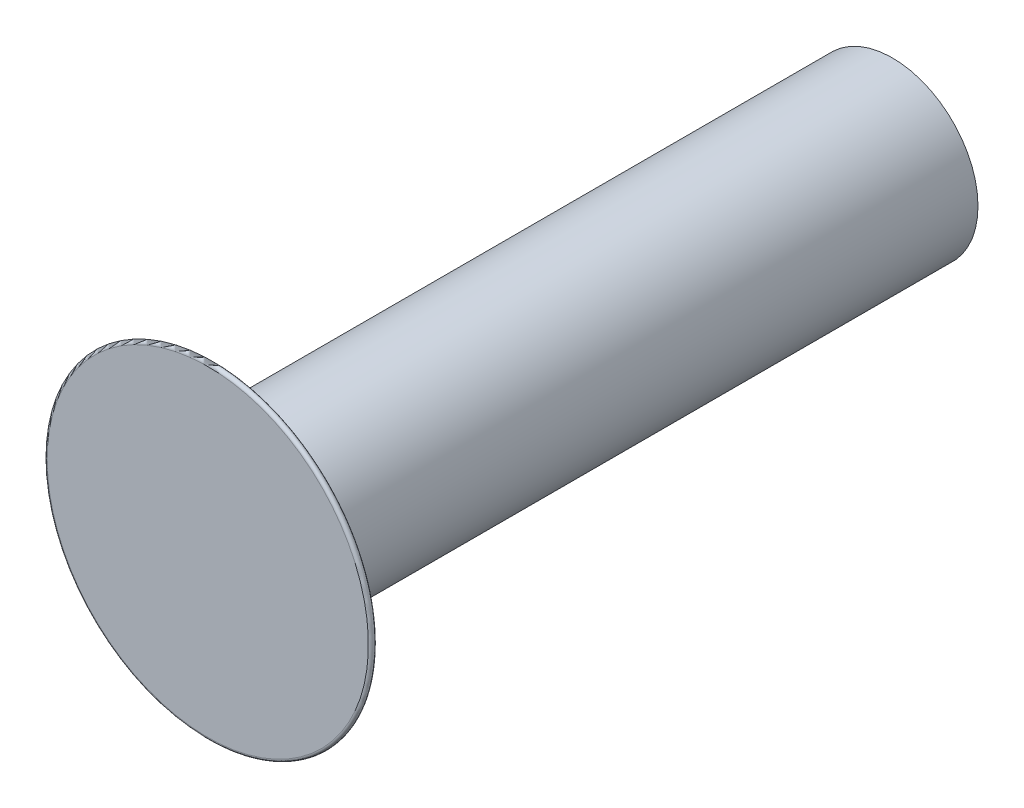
ISO-10303-21;
HEADER;
FILE_DESCRIPTION(('STEP AP214'),'2;1');
FILE_NAME('part.step','',(''),(''),'','','');
FILE_SCHEMA(('AUTOMOTIVE_DESIGN { 1 0 10303 214 1 1 1 1 }'));
ENDSEC;
DATA;
#1=APPLICATION_CONTEXT('core data for automotive mechanical design processes');
#2=APPLICATION_PROTOCOL_DEFINITION('international standard','automotive_design',2000,#1);
#3=PRODUCT_CONTEXT('',#1,'mechanical');
#4=PRODUCT('Part','Part','',(#3));
#5=PRODUCT_RELATED_PRODUCT_CATEGORY('part','',(#4));
#6=PRODUCT_DEFINITION_FORMATION('','',#4);
#7=PRODUCT_DEFINITION_CONTEXT('part definition',#1,'design');
#8=PRODUCT_DEFINITION('design','',#6,#7);
#9=PRODUCT_DEFINITION_SHAPE('','',#8);
#10=(LENGTH_UNIT() NAMED_UNIT(*) SI_UNIT(.MILLI.,.METRE.));
#11=(NAMED_UNIT(*) PLANE_ANGLE_UNIT() SI_UNIT($,.RADIAN.));
#12=(NAMED_UNIT(*) SI_UNIT($,.STERADIAN.) SOLID_ANGLE_UNIT());
#13=UNCERTAINTY_MEASURE_WITH_UNIT(LENGTH_MEASURE(1.E-05),#10,'distance_accuracy_value','');
#14=(GEOMETRIC_REPRESENTATION_CONTEXT(3) GLOBAL_UNCERTAINTY_ASSIGNED_CONTEXT((#13)) GLOBAL_UNIT_ASSIGNED_CONTEXT((#10,
#11,#12)) REPRESENTATION_CONTEXT('',''));
#15=CARTESIAN_POINT('',(0.,0.,0.));
#16=DIRECTION('',(0.,0.,1.));
#17=DIRECTION('',(1.,0.,0.));
#18=AXIS2_PLACEMENT_3D('',#15,#16,#17);
#19=CARTESIAN_POINT('',(0.,0.,-25.4));
#20=DIRECTION('',(0.,0.,1.));
#21=DIRECTION('',(1.,0.,0.));
#22=AXIS2_PLACEMENT_3D('',#19,#20,#21);
#23=PLANE('',#22);
#24=CARTESIAN_POINT('',(0.,0.,-25.4));
#25=DIRECTION('',(0.,0.,1.));
#26=DIRECTION('',(1.,0.,0.));
#27=AXIS2_PLACEMENT_3D('',#24,#25,#26);
#28=CIRCLE('',#27,3.175);
#29=CARTESIAN_POINT('',(3.175,0.,-25.4));
#30=VERTEX_POINT('',#29);
#31=EDGE_CURVE('E48',#30,#30,#28,.T.);
#32=ORIENTED_EDGE('',*,*,#31,.F.);
#33=EDGE_LOOP('',(#32));
#34=FACE_BOUND('',#33,.T.);
#35=ADVANCED_FACE('F37',(#34),#23,.F.);
#36=CARTESIAN_POINT('',(0.,0.,0.));
#37=DIRECTION('',(0.,0.,1.));
#38=DIRECTION('',(1.,0.,0.));
#39=AXIS2_PLACEMENT_3D('',#36,#37,#38);
#40=CYLINDRICAL_SURFACE('',#39,3.175);
#41=CARTESIAN_POINT('',(0.,0.,-1.8542));
#42=DIRECTION('',(0.,0.,1.));
#43=DIRECTION('',(1.,0.,0.));
#44=AXIS2_PLACEMENT_3D('',#41,#42,#43);
#45=CIRCLE('',#44,3.175);
#46=CARTESIAN_POINT('',(3.175,0.,-1.8542));
#47=VERTEX_POINT('',#46);
#48=EDGE_CURVE('E52',#47,#47,#45,.T.);
#49=ORIENTED_EDGE('',*,*,#48,.F.);
#50=EDGE_LOOP('',(#49));
#51=FACE_BOUND('',#50,.T.);
#52=ORIENTED_EDGE('',*,*,#31,.T.);
#53=EDGE_LOOP('',(#52));
#54=FACE_BOUND('',#53,.T.);
#55=ADVANCED_FACE('F60',(#51,#54),#40,.T.);
#56=CARTESIAN_POINT('',(0.,0.,-1.8542));
#57=DIRECTION('',(0.,0.,1.));
#58=DIRECTION('',(1.,0.,0.));
#59=AXIS2_PLACEMENT_3D('',#56,#57,#58);
#60=CONICAL_SURFACE('',#59,3.175,1.04222461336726);
#61=CARTESIAN_POINT('',(0.,0.,-0.197223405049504));
#62=DIRECTION('',(0.,0.,-1.));
#63=DIRECTION('',(-1.,0.,0.));
#64=AXIS2_PLACEMENT_3D('',#61,#62,#63);
#65=CIRCLE('',#64,6.01228868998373);
#66=CARTESIAN_POINT('',(-6.01228868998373,0.,-0.197223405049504));
#67=VERTEX_POINT('',#66);
#68=EDGE_CURVE('E10',#67,#67,#65,.T.);
#69=ORIENTED_EDGE('',*,*,#68,.T.);
#70=EDGE_LOOP('',(#69));
#71=FACE_BOUND('',#70,.T.);
#72=ORIENTED_EDGE('',*,*,#48,.T.);
#73=EDGE_LOOP('',(#72));
#74=FACE_BOUND('',#73,.T.);
#75=ADVANCED_FACE('F58',(#71,#74),#60,.T.);
#76=CARTESIAN_POINT('',(0.,0.,0.));
#77=DIRECTION('',(0.,0.,-1.));
#78=DIRECTION('',(-1.,0.,0.));
#79=AXIS2_PLACEMENT_3D('',#76,#77,#78);
#80=PLANE('',#79);
#81=CARTESIAN_POINT('',(0.,0.,0.));
#82=DIRECTION('',(0.,0.,-1.));
#83=DIRECTION('',(-1.,0.,0.));
#84=AXIS2_PLACEMENT_3D('',#81,#82,#83);
#85=CIRCLE('',#84,5.95891688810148);
#86=CARTESIAN_POINT('',(-5.95891688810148,0.,0.));
#87=VERTEX_POINT('',#86);
#88=EDGE_CURVE('E44',#87,#87,#85,.F.);
#89=ORIENTED_EDGE('',*,*,#88,.T.);
#90=EDGE_LOOP('',(#89));
#91=FACE_BOUND('',#90,.T.);
#92=ADVANCED_FACE('F72',(#91),#80,.F.);
#93=CARTESIAN_POINT('',(0.,0.,-0.105833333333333));
#94=DIRECTION('',(0.,0.,-1.));
#95=DIRECTION('',(-1.,0.,0.));
#96=AXIS2_PLACEMENT_3D('',#93,#94,#95);
#97=TOROIDAL_SURFACE('',#96,5.95891688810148,0.105833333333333);
#98=ORIENTED_EDGE('',*,*,#68,.F.);
#99=EDGE_LOOP('',(#98));
#100=FACE_BOUND('',#99,.T.);
#101=ORIENTED_EDGE('',*,*,#88,.F.);
#102=EDGE_LOOP('',(#101));
#103=FACE_BOUND('',#102,.T.);
#104=ADVANCED_FACE('F39',(#100,#103),#97,.T.);
#105=CLOSED_SHELL('',(#35,#55,#75,#92,#104));
#106=MANIFOLD_SOLID_BREP('B2',#105);
#107=ADVANCED_BREP_SHAPE_REPRESENTATION('',(#18,#106),#14);
#108=SHAPE_DEFINITION_REPRESENTATION(#9,#107);
ENDSEC;
END-ISO-10303-21;
